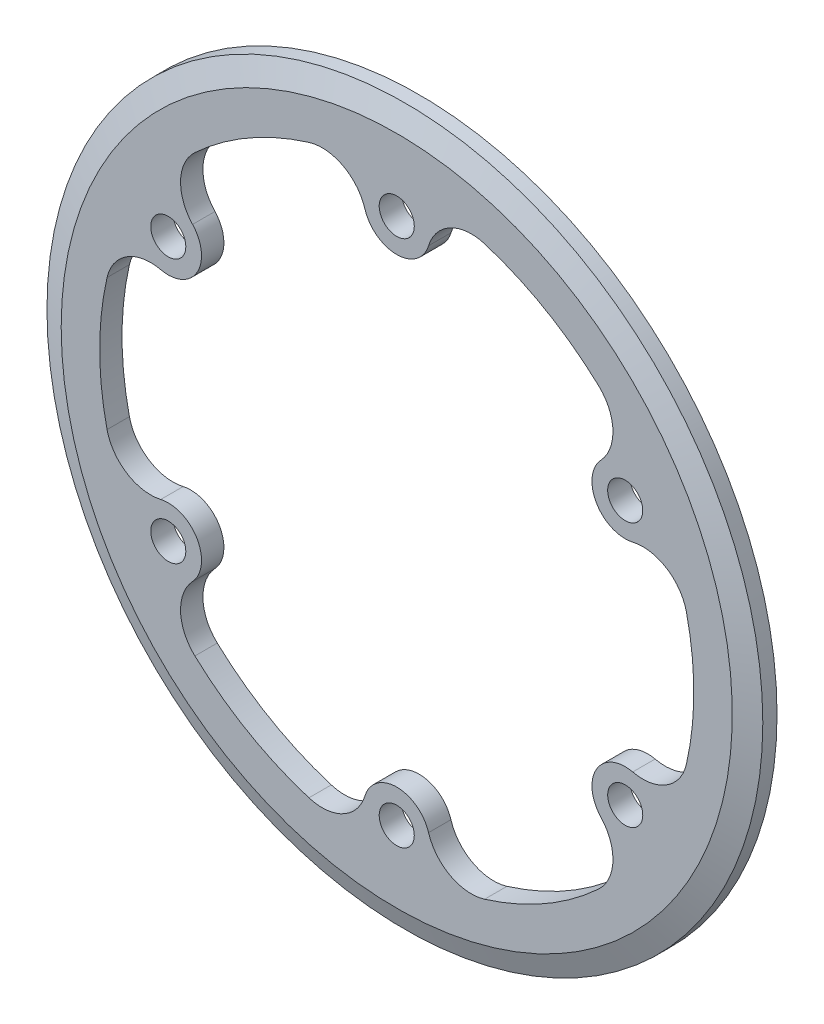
ISO-10303-21;
HEADER;
FILE_DESCRIPTION(('STEP AP214'),'2;1');
FILE_NAME('part.step','',(''),(''),'','','');
FILE_SCHEMA(('AUTOMOTIVE_DESIGN { 1 0 10303 214 1 1 1 1 }'));
ENDSEC;
DATA;
#1=APPLICATION_CONTEXT('core data for automotive mechanical design processes');
#2=APPLICATION_PROTOCOL_DEFINITION('international standard','automotive_design',2000,#1);
#3=PRODUCT_CONTEXT('',#1,'mechanical');
#4=PRODUCT('Part','Part','',(#3));
#5=PRODUCT_RELATED_PRODUCT_CATEGORY('part','',(#4));
#6=PRODUCT_DEFINITION_FORMATION('','',#4);
#7=PRODUCT_DEFINITION_CONTEXT('part definition',#1,'design');
#8=PRODUCT_DEFINITION('design','',#6,#7);
#9=PRODUCT_DEFINITION_SHAPE('','',#8);
#10=(LENGTH_UNIT() NAMED_UNIT(*) SI_UNIT(.MILLI.,.METRE.));
#11=(NAMED_UNIT(*) PLANE_ANGLE_UNIT() SI_UNIT($,.RADIAN.));
#12=(NAMED_UNIT(*) SI_UNIT($,.STERADIAN.) SOLID_ANGLE_UNIT());
#13=UNCERTAINTY_MEASURE_WITH_UNIT(LENGTH_MEASURE(1.E-05),#10,'distance_accuracy_value','');
#14=(GEOMETRIC_REPRESENTATION_CONTEXT(3) GLOBAL_UNCERTAINTY_ASSIGNED_CONTEXT((#13)) GLOBAL_UNIT_ASSIGNED_CONTEXT((#10,
#11,#12)) REPRESENTATION_CONTEXT('',''));
#15=CARTESIAN_POINT('',(0.,0.,0.));
#16=DIRECTION('',(0.,0.,1.));
#17=DIRECTION('',(1.,0.,0.));
#18=AXIS2_PLACEMENT_3D('',#15,#16,#17);
#19=CARTESIAN_POINT('',(0.,0.,1.5875));
#20=DIRECTION('',(0.,0.,1.));
#21=DIRECTION('',(1.,0.,0.));
#22=AXIS2_PLACEMENT_3D('',#19,#20,#21);
#23=PLANE('',#22);
#24=CARTESIAN_POINT('',(-24.3347338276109,26.2766688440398,1.5875));
#25=DIRECTION('',(0.,0.,1.));
#26=DIRECTION('',(1.,0.,0.));
#27=AXIS2_PLACEMENT_3D('',#24,#25,#26);
#28=CIRCLE('',#27,6.34999999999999);
#29=CARTESIAN_POINT('',(-28.9762512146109,21.9432156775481,1.5875));
#30=VERTEX_POINT('',#29);
#31=CARTESIAN_POINT('',(-28.6494029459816,30.9356526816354,1.5875));
#32=VERTEX_POINT('',#31);
#33=EDGE_CURVE('E206',#30,#32,#28,.F.);
#34=ORIENTED_EDGE('',*,*,#33,.T.);
#35=CARTESIAN_POINT('',(0.,0.,1.5875));
#36=DIRECTION('',(0.,0.,1.));
#37=DIRECTION('',(1.,0.,0.));
#38=AXIS2_PLACEMENT_3D('',#35,#36,#37);
#39=CIRCLE('',#38,42.164);
#40=CARTESIAN_POINT('',(-12.466359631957,40.2789370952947,1.5875));
#41=VERTEX_POINT('',#40);
#42=EDGE_CURVE('E203',#32,#41,#39,.F.);
#43=ORIENTED_EDGE('',*,*,#42,.T.);
#44=CARTESIAN_POINT('',(-10.5888958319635,34.2128321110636,1.5875));
#45=DIRECTION('',(0.,0.,1.));
#46=DIRECTION('',(1.,0.,0.));
#47=AXIS2_PLACEMENT_3D('',#44,#45,#46);
#48=CIRCLE('',#47,6.34999999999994);
#49=CARTESIAN_POINT('',(-4.51525661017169,36.0657774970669,1.5875));
#50=VERTEX_POINT('',#49);
#51=EDGE_CURVE('E194',#41,#50,#48,.F.);
#52=ORIENTED_EDGE('',*,*,#51,.T.);
#53=CARTESIAN_POINT('',(0.,37.4432916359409,1.5875));
#54=DIRECTION('',(0.,0.,1.));
#55=DIRECTION('',(1.,0.,0.));
#56=AXIS2_PLACEMENT_3D('',#53,#54,#55);
#57=CIRCLE('',#56,4.72070836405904);
#58=CARTESIAN_POINT('',(4.51525661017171,36.0657774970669,1.5875));
#59=VERTEX_POINT('',#58);
#60=EDGE_CURVE('E188',#59,#50,#57,.F.);
#61=ORIENTED_EDGE('',*,*,#60,.F.);
#62=CARTESIAN_POINT('',(10.5888958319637,34.2128321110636,1.5875));
#63=DIRECTION('',(0.,0.,1.));
#64=DIRECTION('',(1.,0.,0.));
#65=AXIS2_PLACEMENT_3D('',#62,#63,#64);
#66=CIRCLE('',#65,6.34999999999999);
#67=CARTESIAN_POINT('',(12.4663596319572,40.2789370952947,1.5875));
#68=VERTEX_POINT('',#67);
#69=EDGE_CURVE('E175',#59,#68,#66,.F.);
#70=ORIENTED_EDGE('',*,*,#69,.T.);
#71=CARTESIAN_POINT('',(0.,0.,1.5875));
#72=DIRECTION('',(0.,0.,1.));
#73=DIRECTION('',(1.,0.,0.));
#74=AXIS2_PLACEMENT_3D('',#71,#72,#73);
#75=CIRCLE('',#74,42.164);
#76=CARTESIAN_POINT('',(28.6494029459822,30.9356526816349,1.5875));
#77=VERTEX_POINT('',#76);
#78=EDGE_CURVE('E269',#68,#77,#75,.F.);
#79=ORIENTED_EDGE('',*,*,#78,.T.);
#80=CARTESIAN_POINT('',(24.3347338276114,26.2766688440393,1.5875));
#81=DIRECTION('',(0.,0.,1.));
#82=DIRECTION('',(1.,0.,0.));
#83=AXIS2_PLACEMENT_3D('',#80,#81,#82);
#84=CIRCLE('',#83,6.34999999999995);
#85=CARTESIAN_POINT('',(28.9762512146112,21.9432156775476,1.5875));
#86=VERTEX_POINT('',#85);
#87=EDGE_CURVE('E265',#77,#86,#84,.F.);
#88=ORIENTED_EDGE('',*,*,#87,.T.);
#89=CARTESIAN_POINT('',(32.4268417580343,18.7216458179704,1.5875));
#90=DIRECTION('',(0.,0.,1.));
#91=DIRECTION('',(1.,0.,0.));
#92=AXIS2_PLACEMENT_3D('',#89,#90,#91);
#93=CIRCLE('',#92,4.72070836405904);
#94=CARTESIAN_POINT('',(33.4915078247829,14.122561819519,1.5875));
#95=VERTEX_POINT('',#94);
#96=EDGE_CURVE('E262',#95,#86,#93,.F.);
#97=ORIENTED_EDGE('',*,*,#96,.F.);
#98=CARTESIAN_POINT('',(34.9236296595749,7.93616326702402,1.5875));
#99=DIRECTION('',(0.,0.,1.));
#100=DIRECTION('',(1.,0.,0.));
#101=AXIS2_PLACEMENT_3D('',#98,#99,#100);
#102=CIRCLE('',#101,6.35);
#103=CARTESIAN_POINT('',(41.1157625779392,9.34328441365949,1.5875));
#104=VERTEX_POINT('',#103);
#105=EDGE_CURVE('E258',#95,#104,#102,.F.);
#106=ORIENTED_EDGE('',*,*,#105,.T.);
#107=CARTESIAN_POINT('',(0.,0.,1.5875));
#108=DIRECTION('',(0.,0.,1.));
#109=DIRECTION('',(1.,0.,0.));
#110=AXIS2_PLACEMENT_3D('',#107,#108,#109);
#111=CIRCLE('',#110,42.164);
#112=CARTESIAN_POINT('',(41.1157625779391,-9.34328441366,1.5875));
#113=VERTEX_POINT('',#112);
#114=EDGE_CURVE('E255',#104,#113,#111,.F.);
#115=ORIENTED_EDGE('',*,*,#114,.T.);
#116=CARTESIAN_POINT('',(34.9236296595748,-7.93616326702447,1.5875));
#117=DIRECTION('',(0.,0.,1.));
#118=DIRECTION('',(1.,0.,0.));
#119=AXIS2_PLACEMENT_3D('',#116,#117,#118);
#120=CIRCLE('',#119,6.34999999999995);
#121=CARTESIAN_POINT('',(33.4915078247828,-14.1225618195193,1.5875));
#122=VERTEX_POINT('',#121);
#123=EDGE_CURVE('E251',#113,#122,#120,.F.);
#124=ORIENTED_EDGE('',*,*,#123,.T.);
#125=CARTESIAN_POINT('',(32.4268417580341,-18.7216458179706,1.5875));
#126=DIRECTION('',(0.,0.,1.));
#127=DIRECTION('',(1.,0.,0.));
#128=AXIS2_PLACEMENT_3D('',#125,#126,#127);
#129=CIRCLE('',#128,4.72070836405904);
#130=CARTESIAN_POINT('',(28.9762512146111,-21.9432156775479,1.5875));
#131=VERTEX_POINT('',#130);
#132=EDGE_CURVE('E248',#131,#122,#129,.F.);
#133=ORIENTED_EDGE('',*,*,#132,.F.);
#134=CARTESIAN_POINT('',(24.3347338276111,-26.2766688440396,1.5875));
#135=DIRECTION('',(0.,0.,1.));
#136=DIRECTION('',(1.,0.,0.));
#137=AXIS2_PLACEMENT_3D('',#134,#135,#136);
#138=CIRCLE('',#137,6.34999999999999);
#139=CARTESIAN_POINT('',(28.6494029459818,-30.9356526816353,1.5875));
#140=VERTEX_POINT('',#139);
#141=EDGE_CURVE('E245',#131,#140,#138,.F.);
#142=ORIENTED_EDGE('',*,*,#141,.T.);
#143=CARTESIAN_POINT('',(0.,0.,1.5875));
#144=DIRECTION('',(0.,0.,1.));
#145=DIRECTION('',(1.,0.,0.));
#146=AXIS2_PLACEMENT_3D('',#143,#144,#145);
#147=CIRCLE('',#146,42.164);
#148=CARTESIAN_POINT('',(12.466359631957,-40.2789370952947,1.5875));
#149=VERTEX_POINT('',#148);
#150=EDGE_CURVE('E242',#140,#149,#147,.F.);
#151=ORIENTED_EDGE('',*,*,#150,.T.);
#152=CARTESIAN_POINT('',(10.5888958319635,-34.2128321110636,1.5875));
#153=DIRECTION('',(0.,0.,1.));
#154=DIRECTION('',(1.,0.,0.));
#155=AXIS2_PLACEMENT_3D('',#152,#153,#154);
#156=CIRCLE('',#155,6.34999999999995);
#157=CARTESIAN_POINT('',(4.51525661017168,-36.0657774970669,1.5875));
#158=VERTEX_POINT('',#157);
#159=EDGE_CURVE('E238',#149,#158,#156,.F.);
#160=ORIENTED_EDGE('',*,*,#159,.T.);
#161=CARTESIAN_POINT('',(0.,-37.4432916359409,1.5875));
#162=DIRECTION('',(0.,0.,1.));
#163=DIRECTION('',(1.,0.,0.));
#164=AXIS2_PLACEMENT_3D('',#161,#162,#163);
#165=CIRCLE('',#164,4.72070836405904);
#166=CARTESIAN_POINT('',(-4.51525661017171,-36.0657774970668,1.5875));
#167=VERTEX_POINT('',#166);
#168=EDGE_CURVE('E235',#167,#158,#165,.F.);
#169=ORIENTED_EDGE('',*,*,#168,.F.);
#170=CARTESIAN_POINT('',(-10.5888958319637,-34.2128321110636,1.5875));
#171=DIRECTION('',(0.,0.,1.));
#172=DIRECTION('',(1.,0.,0.));
#173=AXIS2_PLACEMENT_3D('',#170,#171,#172);
#174=CIRCLE('',#173,6.35);
#175=CARTESIAN_POINT('',(-12.4663596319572,-40.2789370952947,1.5875));
#176=VERTEX_POINT('',#175);
#177=EDGE_CURVE('E232',#167,#176,#174,.F.);
#178=ORIENTED_EDGE('',*,*,#177,.T.);
#179=CARTESIAN_POINT('',(0.,0.,1.5875));
#180=DIRECTION('',(0.,0.,1.));
#181=DIRECTION('',(1.,0.,0.));
#182=AXIS2_PLACEMENT_3D('',#179,#180,#181);
#183=CIRCLE('',#182,42.164);
#184=CARTESIAN_POINT('',(-28.6494029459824,-30.9356526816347,1.5875));
#185=VERTEX_POINT('',#184);
#186=EDGE_CURVE('E229',#176,#185,#183,.F.);
#187=ORIENTED_EDGE('',*,*,#186,.T.);
#188=CARTESIAN_POINT('',(-24.3347338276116,-26.2766688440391,1.5875));
#189=DIRECTION('',(0.,0.,1.));
#190=DIRECTION('',(1.,0.,0.));
#191=AXIS2_PLACEMENT_3D('',#188,#189,#190);
#192=CIRCLE('',#191,6.34999999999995);
#193=CARTESIAN_POINT('',(-28.9762512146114,-21.9432156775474,1.5875));
#194=VERTEX_POINT('',#193);
#195=EDGE_CURVE('E225',#185,#194,#192,.F.);
#196=ORIENTED_EDGE('',*,*,#195,.T.);
#197=CARTESIAN_POINT('',(-32.4268417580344,-18.7216458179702,1.5875));
#198=DIRECTION('',(0.,0.,1.));
#199=DIRECTION('',(1.,0.,0.));
#200=AXIS2_PLACEMENT_3D('',#197,#198,#199);
#201=CIRCLE('',#200,4.72070836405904);
#202=CARTESIAN_POINT('',(-33.491507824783,-14.1225618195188,1.5875));
#203=VERTEX_POINT('',#202);
#204=EDGE_CURVE('E222',#203,#194,#201,.F.);
#205=ORIENTED_EDGE('',*,*,#204,.F.);
#206=CARTESIAN_POINT('',(-34.9236296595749,-7.93616326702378,1.5875));
#207=DIRECTION('',(0.,0.,1.));
#208=DIRECTION('',(1.,0.,0.));
#209=AXIS2_PLACEMENT_3D('',#206,#207,#208);
#210=CIRCLE('',#209,6.35);
#211=CARTESIAN_POINT('',(-41.1157625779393,-9.34328441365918,1.5875));
#212=VERTEX_POINT('',#211);
#213=EDGE_CURVE('E219',#203,#212,#210,.F.);
#214=ORIENTED_EDGE('',*,*,#213,.T.);
#215=CARTESIAN_POINT('',(0.,0.,1.5875));
#216=DIRECTION('',(0.,0.,1.));
#217=DIRECTION('',(1.,0.,0.));
#218=AXIS2_PLACEMENT_3D('',#215,#216,#217);
#219=CIRCLE('',#218,42.164);
#220=CARTESIAN_POINT('',(-41.115762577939,9.34328441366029,1.5875));
#221=VERTEX_POINT('',#220);
#222=EDGE_CURVE('E216',#212,#221,#219,.F.);
#223=ORIENTED_EDGE('',*,*,#222,.T.);
#224=CARTESIAN_POINT('',(-34.9236296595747,7.93616326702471,1.5875));
#225=DIRECTION('',(0.,0.,1.));
#226=DIRECTION('',(1.,0.,0.));
#227=AXIS2_PLACEMENT_3D('',#224,#225,#226);
#228=CIRCLE('',#227,6.34999999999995);
#229=CARTESIAN_POINT('',(-33.4915078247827,14.1225618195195,1.5875));
#230=VERTEX_POINT('',#229);
#231=EDGE_CURVE('E212',#221,#230,#228,.F.);
#232=ORIENTED_EDGE('',*,*,#231,.T.);
#233=CARTESIAN_POINT('',(-32.426841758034,18.7216458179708,1.5875));
#234=DIRECTION('',(0.,0.,1.));
#235=DIRECTION('',(1.,0.,0.));
#236=AXIS2_PLACEMENT_3D('',#233,#234,#235);
#237=CIRCLE('',#236,4.72070836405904);
#238=EDGE_CURVE('E209',#30,#230,#237,.F.);
#239=ORIENTED_EDGE('',*,*,#238,.F.);
#240=EDGE_LOOP('',(#34,#43,#52,#61,#70,#79,#88,#97,#106,#115,#124,#133,#142,#151,#160,#169,#178,
#187,#196,#205,#214,#223,#232,#239));
#241=FACE_BOUND('',#240,.T.);
#242=CARTESIAN_POINT('',(0.,37.4432916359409,1.5875));
#243=DIRECTION('',(0.,0.,1.));
#244=DIRECTION('',(1.,0.,0.));
#245=AXIS2_PLACEMENT_3D('',#242,#243,#244);
#246=CIRCLE('',#245,2.4892);
#247=CARTESIAN_POINT('',(2.4892,37.4432916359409,1.5875));
#248=VERTEX_POINT('',#247);
#249=EDGE_CURVE('E185',#248,#248,#246,.F.);
#250=ORIENTED_EDGE('',*,*,#249,.T.);
#251=EDGE_LOOP('',(#250));
#252=FACE_BOUND('',#251,.T.);
#253=CARTESIAN_POINT('',(32.4268417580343,18.7216458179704,1.5875));
#254=DIRECTION('',(0.,0.,1.));
#255=DIRECTION('',(1.,0.,0.));
#256=AXIS2_PLACEMENT_3D('',#253,#254,#255);
#257=CIRCLE('',#256,2.4892);
#258=CARTESIAN_POINT('',(34.9160417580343,18.7216458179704,1.5875));
#259=VERTEX_POINT('',#258);
#260=EDGE_CURVE('E273',#259,#259,#257,.F.);
#261=ORIENTED_EDGE('',*,*,#260,.T.);
#262=EDGE_LOOP('',(#261));
#263=FACE_BOUND('',#262,.T.);
#264=CARTESIAN_POINT('',(32.4268417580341,-18.7216458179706,1.5875));
#265=DIRECTION('',(0.,0.,1.));
#266=DIRECTION('',(1.,0.,0.));
#267=AXIS2_PLACEMENT_3D('',#264,#265,#266);
#268=CIRCLE('',#267,2.4892);
#269=CARTESIAN_POINT('',(34.9160417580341,-18.7216458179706,1.5875));
#270=VERTEX_POINT('',#269);
#271=EDGE_CURVE('E276',#270,#270,#268,.F.);
#272=ORIENTED_EDGE('',*,*,#271,.T.);
#273=EDGE_LOOP('',(#272));
#274=FACE_BOUND('',#273,.T.);
#275=CARTESIAN_POINT('',(0.,-37.4432916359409,1.5875));
#276=DIRECTION('',(0.,0.,1.));
#277=DIRECTION('',(1.,0.,0.));
#278=AXIS2_PLACEMENT_3D('',#275,#276,#277);
#279=CIRCLE('',#278,2.4892);
#280=CARTESIAN_POINT('',(2.4892,-37.4432916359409,1.5875));
#281=VERTEX_POINT('',#280);
#282=EDGE_CURVE('E279',#281,#281,#279,.F.);
#283=ORIENTED_EDGE('',*,*,#282,.T.);
#284=EDGE_LOOP('',(#283));
#285=FACE_BOUND('',#284,.T.);
#286=CARTESIAN_POINT('',(-32.4268417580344,-18.7216458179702,1.5875));
#287=DIRECTION('',(0.,0.,1.));
#288=DIRECTION('',(1.,0.,0.));
#289=AXIS2_PLACEMENT_3D('',#286,#287,#288);
#290=CIRCLE('',#289,2.4892);
#291=CARTESIAN_POINT('',(-29.9376417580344,-18.7216458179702,1.5875));
#292=VERTEX_POINT('',#291);
#293=EDGE_CURVE('E282',#292,#292,#290,.F.);
#294=ORIENTED_EDGE('',*,*,#293,.T.);
#295=EDGE_LOOP('',(#294));
#296=FACE_BOUND('',#295,.T.);
#297=CARTESIAN_POINT('',(-32.426841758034,18.7216458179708,1.5875));
#298=DIRECTION('',(0.,0.,1.));
#299=DIRECTION('',(1.,0.,0.));
#300=AXIS2_PLACEMENT_3D('',#297,#298,#299);
#301=CIRCLE('',#300,2.4892);
#302=CARTESIAN_POINT('',(-29.937641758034,18.7216458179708,1.5875));
#303=VERTEX_POINT('',#302);
#304=EDGE_CURVE('E284',#303,#303,#301,.F.);
#305=ORIENTED_EDGE('',*,*,#304,.T.);
#306=EDGE_LOOP('',(#305));
#307=FACE_BOUND('',#306,.T.);
#308=CARTESIAN_POINT('',(0.,0.,1.5875));
#309=DIRECTION('',(0.,0.,-1.));
#310=DIRECTION('',(-1.,0.,0.));
#311=AXIS2_PLACEMENT_3D('',#308,#309,#310);
#312=CIRCLE('',#311,47.625);
#313=CARTESIAN_POINT('',(-47.625,0.,1.5875));
#314=VERTEX_POINT('',#313);
#315=EDGE_CURVE('E19',#314,#314,#312,.T.);
#316=ORIENTED_EDGE('',*,*,#315,.F.);
#317=EDGE_LOOP('',(#316));
#318=FACE_BOUND('',#317,.T.);
#319=ADVANCED_FACE('F16',(#241,#252,#263,#274,#285,#296,#307,#318),#23,.T.);
#320=CARTESIAN_POINT('',(0.,0.,0.431894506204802));
#321=DIRECTION('',(0.,0.,-1.));
#322=DIRECTION('',(-1.,0.,0.));
#323=AXIS2_PLACEMENT_3D('',#320,#321,#322);
#324=CONICAL_SURFACE('',#323,50.8,1.22173047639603);
#325=ORIENTED_EDGE('',*,*,#315,.T.);
#326=EDGE_LOOP('',(#325));
#327=FACE_BOUND('',#326,.T.);
#328=CARTESIAN_POINT('',(0.,0.,0.431894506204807));
#329=DIRECTION('',(0.,0.,-1.));
#330=DIRECTION('',(-1.,0.,0.));
#331=AXIS2_PLACEMENT_3D('',#328,#329,#330);
#332=CIRCLE('',#331,50.8);
#333=CARTESIAN_POINT('',(-50.8,0.,0.431894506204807));
#334=VERTEX_POINT('',#333);
#335=EDGE_CURVE('E190',#334,#334,#332,.T.);
#336=ORIENTED_EDGE('',*,*,#335,.F.);
#337=EDGE_LOOP('',(#336));
#338=FACE_BOUND('',#337,.T.);
#339=ADVANCED_FACE('F291',(#327,#338),#324,.T.);
#340=CARTESIAN_POINT('',(-32.426841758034,18.7216458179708,-1.5875));
#341=DIRECTION('',(0.,0.,1.));
#342=DIRECTION('',(1.,0.,0.));
#343=AXIS2_PLACEMENT_3D('',#340,#341,#342);
#344=CYLINDRICAL_SURFACE('',#343,2.4892);
#345=CARTESIAN_POINT('',(-32.426841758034,18.7216458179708,-1.5875));
#346=DIRECTION('',(0.,0.,1.));
#347=DIRECTION('',(1.,0.,0.));
#348=AXIS2_PLACEMENT_3D('',#345,#346,#347);
#349=CIRCLE('',#348,2.4892);
#350=CARTESIAN_POINT('',(-29.937641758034,18.7216458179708,-1.5875));
#351=VERTEX_POINT('',#350);
#352=EDGE_CURVE('E200',#351,#351,#349,.F.);
#353=ORIENTED_EDGE('',*,*,#352,.T.);
#354=EDGE_LOOP('',(#353));
#355=FACE_BOUND('',#354,.T.);
#356=ORIENTED_EDGE('',*,*,#304,.F.);
#357=EDGE_LOOP('',(#356));
#358=FACE_BOUND('',#357,.T.);
#359=ADVANCED_FACE('F299',(#355,#358),#344,.F.);
#360=CARTESIAN_POINT('',(-32.4268417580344,-18.7216458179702,-1.5875));
#361=DIRECTION('',(0.,0.,1.));
#362=DIRECTION('',(1.,0.,0.));
#363=AXIS2_PLACEMENT_3D('',#360,#361,#362);
#364=CYLINDRICAL_SURFACE('',#363,2.4892);
#365=CARTESIAN_POINT('',(-32.4268417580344,-18.7216458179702,-1.5875));
#366=DIRECTION('',(0.,0.,1.));
#367=DIRECTION('',(1.,0.,0.));
#368=AXIS2_PLACEMENT_3D('',#365,#366,#367);
#369=CIRCLE('',#368,2.4892);
#370=CARTESIAN_POINT('',(-29.9376417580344,-18.7216458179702,-1.5875));
#371=VERTEX_POINT('',#370);
#372=EDGE_CURVE('E433',#371,#371,#369,.F.);
#373=ORIENTED_EDGE('',*,*,#372,.T.);
#374=EDGE_LOOP('',(#373));
#375=FACE_BOUND('',#374,.T.);
#376=ORIENTED_EDGE('',*,*,#293,.F.);
#377=EDGE_LOOP('',(#376));
#378=FACE_BOUND('',#377,.T.);
#379=ADVANCED_FACE('F420',(#375,#378),#364,.F.);
#380=CARTESIAN_POINT('',(0.,-37.4432916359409,-1.5875));
#381=DIRECTION('',(0.,0.,1.));
#382=DIRECTION('',(1.,0.,0.));
#383=AXIS2_PLACEMENT_3D('',#380,#381,#382);
#384=CYLINDRICAL_SURFACE('',#383,2.4892);
#385=CARTESIAN_POINT('',(0.,-37.4432916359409,-1.5875));
#386=DIRECTION('',(0.,0.,1.));
#387=DIRECTION('',(1.,0.,0.));
#388=AXIS2_PLACEMENT_3D('',#385,#386,#387);
#389=CIRCLE('',#388,2.4892);
#390=CARTESIAN_POINT('',(2.4892,-37.4432916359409,-1.5875));
#391=VERTEX_POINT('',#390);
#392=EDGE_CURVE('E435',#391,#391,#389,.F.);
#393=ORIENTED_EDGE('',*,*,#392,.T.);
#394=EDGE_LOOP('',(#393));
#395=FACE_BOUND('',#394,.T.);
#396=ORIENTED_EDGE('',*,*,#282,.F.);
#397=EDGE_LOOP('',(#396));
#398=FACE_BOUND('',#397,.T.);
#399=ADVANCED_FACE('F416',(#395,#398),#384,.F.);
#400=CARTESIAN_POINT('',(32.4268417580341,-18.7216458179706,-1.5875));
#401=DIRECTION('',(0.,0.,1.));
#402=DIRECTION('',(1.,0.,0.));
#403=AXIS2_PLACEMENT_3D('',#400,#401,#402);
#404=CYLINDRICAL_SURFACE('',#403,2.4892);
#405=CARTESIAN_POINT('',(32.4268417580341,-18.7216458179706,-1.5875));
#406=DIRECTION('',(0.,0.,1.));
#407=DIRECTION('',(1.,0.,0.));
#408=AXIS2_PLACEMENT_3D('',#405,#406,#407);
#409=CIRCLE('',#408,2.4892);
#410=CARTESIAN_POINT('',(34.9160417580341,-18.7216458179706,-1.5875));
#411=VERTEX_POINT('',#410);
#412=EDGE_CURVE('E512',#411,#411,#409,.F.);
#413=ORIENTED_EDGE('',*,*,#412,.T.);
#414=EDGE_LOOP('',(#413));
#415=FACE_BOUND('',#414,.T.);
#416=ORIENTED_EDGE('',*,*,#271,.F.);
#417=EDGE_LOOP('',(#416));
#418=FACE_BOUND('',#417,.T.);
#419=ADVANCED_FACE('F412',(#415,#418),#404,.F.);
#420=CARTESIAN_POINT('',(32.4268417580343,18.7216458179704,-1.5875));
#421=DIRECTION('',(0.,0.,1.));
#422=DIRECTION('',(1.,0.,0.));
#423=AXIS2_PLACEMENT_3D('',#420,#421,#422);
#424=CYLINDRICAL_SURFACE('',#423,2.4892);
#425=CARTESIAN_POINT('',(32.4268417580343,18.7216458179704,-1.5875));
#426=DIRECTION('',(0.,0.,1.));
#427=DIRECTION('',(1.,0.,0.));
#428=AXIS2_PLACEMENT_3D('',#425,#426,#427);
#429=CIRCLE('',#428,2.4892);
#430=CARTESIAN_POINT('',(34.9160417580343,18.7216458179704,-1.5875));
#431=VERTEX_POINT('',#430);
#432=EDGE_CURVE('E509',#431,#431,#429,.F.);
#433=ORIENTED_EDGE('',*,*,#432,.T.);
#434=EDGE_LOOP('',(#433));
#435=FACE_BOUND('',#434,.T.);
#436=ORIENTED_EDGE('',*,*,#260,.F.);
#437=EDGE_LOOP('',(#436));
#438=FACE_BOUND('',#437,.T.);
#439=ADVANCED_FACE('F408',(#435,#438),#424,.F.);
#440=CARTESIAN_POINT('',(0.,37.4432916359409,-1.5875));
#441=DIRECTION('',(0.,0.,1.));
#442=DIRECTION('',(1.,0.,0.));
#443=AXIS2_PLACEMENT_3D('',#440,#441,#442);
#444=CYLINDRICAL_SURFACE('',#443,2.4892);
#445=CARTESIAN_POINT('',(0.,37.4432916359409,-1.5875));
#446=DIRECTION('',(0.,0.,1.));
#447=DIRECTION('',(1.,0.,0.));
#448=AXIS2_PLACEMENT_3D('',#445,#446,#447);
#449=CIRCLE('',#448,2.4892);
#450=CARTESIAN_POINT('',(2.4892,37.4432916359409,-1.5875));
#451=VERTEX_POINT('',#450);
#452=EDGE_CURVE('E506',#451,#451,#449,.F.);
#453=ORIENTED_EDGE('',*,*,#452,.T.);
#454=EDGE_LOOP('',(#453));
#455=FACE_BOUND('',#454,.T.);
#456=ORIENTED_EDGE('',*,*,#249,.F.);
#457=EDGE_LOOP('',(#456));
#458=FACE_BOUND('',#457,.T.);
#459=ADVANCED_FACE('F405',(#455,#458),#444,.F.);
#460=CARTESIAN_POINT('',(10.5888958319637,34.2128321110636,-1.5875));
#461=DIRECTION('',(0.,0.,1.));
#462=DIRECTION('',(1.,0.,0.));
#463=AXIS2_PLACEMENT_3D('',#460,#461,#462);
#464=CYLINDRICAL_SURFACE('',#463,6.34999999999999);
#465=DIRECTION('',(0.,0.,1.));
#466=VECTOR('',#465,1.);
#467=CARTESIAN_POINT('',(4.51525661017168,36.0657774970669,-1.5875));
#468=LINE('',#467,#466);
#469=CARTESIAN_POINT('',(4.51525661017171,36.0657774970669,-1.5875));
#470=VERTEX_POINT('',#469);
#471=EDGE_CURVE('E179',#470,#59,#468,.T.);
#472=ORIENTED_EDGE('',*,*,#471,.F.);
#473=CARTESIAN_POINT('',(10.5888958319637,34.2128321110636,-1.5875));
#474=DIRECTION('',(0.,0.,1.));
#475=DIRECTION('',(1.,0.,0.));
#476=AXIS2_PLACEMENT_3D('',#473,#474,#475);
#477=CIRCLE('',#476,6.34999999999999);
#478=CARTESIAN_POINT('',(12.4663596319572,40.2789370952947,-1.5875));
#479=VERTEX_POINT('',#478);
#480=EDGE_CURVE('E504',#470,#479,#477,.F.);
#481=ORIENTED_EDGE('',*,*,#480,.T.);
#482=DIRECTION('',(0.,0.,1.));
#483=VECTOR('',#482,1.);
#484=CARTESIAN_POINT('',(12.4663596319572,40.2789370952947,-1.5875));
#485=LINE('',#484,#483);
#486=EDGE_CURVE('E180',#479,#68,#485,.T.);
#487=ORIENTED_EDGE('',*,*,#486,.T.);
#488=ORIENTED_EDGE('',*,*,#69,.F.);
#489=EDGE_LOOP('',(#472,#481,#487,#488));
#490=FACE_BOUND('',#489,.T.);
#491=ADVANCED_FACE('F177',(#490),#464,.F.);
#492=CARTESIAN_POINT('',(0.,0.,-1.5875));
#493=DIRECTION('',(0.,0.,1.));
#494=DIRECTION('',(1.,0.,0.));
#495=AXIS2_PLACEMENT_3D('',#492,#493,#494);
#496=CYLINDRICAL_SURFACE('',#495,42.164);
#497=ORIENTED_EDGE('',*,*,#486,.F.);
#498=CARTESIAN_POINT('',(0.,0.,-1.5875));
#499=DIRECTION('',(0.,0.,1.));
#500=DIRECTION('',(1.,0.,0.));
#501=AXIS2_PLACEMENT_3D('',#498,#499,#500);
#502=CIRCLE('',#501,42.164);
#503=CARTESIAN_POINT('',(28.6494029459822,30.9356526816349,-1.5875));
#504=VERTEX_POINT('',#503);
#505=EDGE_CURVE('E501',#479,#504,#502,.F.);
#506=ORIENTED_EDGE('',*,*,#505,.T.);
#507=DIRECTION('',(0.,0.,1.));
#508=VECTOR('',#507,1.);
#509=CARTESIAN_POINT('',(28.6494029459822,30.9356526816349,-1.5875));
#510=LINE('',#509,#508);
#511=EDGE_CURVE('E268',#504,#77,#510,.T.);
#512=ORIENTED_EDGE('',*,*,#511,.T.);
#513=ORIENTED_EDGE('',*,*,#78,.F.);
#514=EDGE_LOOP('',(#497,#506,#512,#513));
#515=FACE_BOUND('',#514,.T.);
#516=ADVANCED_FACE('F398',(#515),#496,.F.);
#517=CARTESIAN_POINT('',(24.3347338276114,26.2766688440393,-1.5875));
#518=DIRECTION('',(0.,0.,1.));
#519=DIRECTION('',(1.,0.,0.));
#520=AXIS2_PLACEMENT_3D('',#517,#518,#519);
#521=CYLINDRICAL_SURFACE('',#520,6.34999999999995);
#522=CARTESIAN_POINT('',(24.3347338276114,26.2766688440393,-1.5875));
#523=DIRECTION('',(0.,0.,1.));
#524=DIRECTION('',(1.,0.,0.));
#525=AXIS2_PLACEMENT_3D('',#522,#523,#524);
#526=CIRCLE('',#525,6.34999999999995);
#527=CARTESIAN_POINT('',(28.9762512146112,21.9432156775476,-1.5875));
#528=VERTEX_POINT('',#527);
#529=EDGE_CURVE('E499',#504,#528,#526,.F.);
#530=ORIENTED_EDGE('',*,*,#529,.T.);
#531=DIRECTION('',(0.,0.,1.));
#532=VECTOR('',#531,1.);
#533=CARTESIAN_POINT('',(28.9762512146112,21.9432156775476,-1.5875));
#534=LINE('',#533,#532);
#535=EDGE_CURVE('E264',#86,#528,#534,.F.);
#536=ORIENTED_EDGE('',*,*,#535,.F.);
#537=ORIENTED_EDGE('',*,*,#87,.F.);
#538=ORIENTED_EDGE('',*,*,#511,.F.);
#539=EDGE_LOOP('',(#530,#536,#537,#538));
#540=FACE_BOUND('',#539,.T.);
#541=ADVANCED_FACE('F394',(#540),#521,.F.);
#542=CARTESIAN_POINT('',(32.4268417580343,18.7216458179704,-1.5875));
#543=DIRECTION('',(0.,0.,1.));
#544=DIRECTION('',(1.,0.,0.));
#545=AXIS2_PLACEMENT_3D('',#542,#543,#544);
#546=CYLINDRICAL_SURFACE('',#545,4.72070836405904);
#547=CARTESIAN_POINT('',(32.4268417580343,18.7216458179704,-1.5875));
#548=DIRECTION('',(0.,0.,1.));
#549=DIRECTION('',(1.,0.,0.));
#550=AXIS2_PLACEMENT_3D('',#547,#548,#549);
#551=CIRCLE('',#550,4.72070836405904);
#552=CARTESIAN_POINT('',(33.4915078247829,14.122561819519,-1.5875));
#553=VERTEX_POINT('',#552);
#554=EDGE_CURVE('E496',#528,#553,#551,.T.);
#555=ORIENTED_EDGE('',*,*,#554,.T.);
#556=DIRECTION('',(0.,0.,1.));
#557=VECTOR('',#556,1.);
#558=CARTESIAN_POINT('',(33.4915078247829,14.122561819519,-1.5875));
#559=LINE('',#558,#557);
#560=EDGE_CURVE('E261',#553,#95,#559,.T.);
#561=ORIENTED_EDGE('',*,*,#560,.T.);
#562=ORIENTED_EDGE('',*,*,#96,.T.);
#563=ORIENTED_EDGE('',*,*,#535,.T.);
#564=EDGE_LOOP('',(#555,#561,#562,#563));
#565=FACE_BOUND('',#564,.T.);
#566=ADVANCED_FACE('F390',(#565),#546,.T.);
#567=CARTESIAN_POINT('',(34.9236296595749,7.93616326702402,-1.5875));
#568=DIRECTION('',(0.,0.,1.));
#569=DIRECTION('',(1.,0.,0.));
#570=AXIS2_PLACEMENT_3D('',#567,#568,#569);
#571=CYLINDRICAL_SURFACE('',#570,6.35);
#572=ORIENTED_EDGE('',*,*,#560,.F.);
#573=CARTESIAN_POINT('',(34.9236296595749,7.93616326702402,-1.5875));
#574=DIRECTION('',(0.,0.,1.));
#575=DIRECTION('',(1.,0.,0.));
#576=AXIS2_PLACEMENT_3D('',#573,#574,#575);
#577=CIRCLE('',#576,6.35);
#578=CARTESIAN_POINT('',(41.1157625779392,9.34328441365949,-1.5875));
#579=VERTEX_POINT('',#578);
#580=EDGE_CURVE('E493',#553,#579,#577,.F.);
#581=ORIENTED_EDGE('',*,*,#580,.T.);
#582=DIRECTION('',(0.,0.,1.));
#583=VECTOR('',#582,1.);
#584=CARTESIAN_POINT('',(41.1157625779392,9.3432844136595,-1.5875));
#585=LINE('',#584,#583);
#586=EDGE_CURVE('E257',#579,#104,#585,.T.);
#587=ORIENTED_EDGE('',*,*,#586,.T.);
#588=ORIENTED_EDGE('',*,*,#105,.F.);
#589=EDGE_LOOP('',(#572,#581,#587,#588));
#590=FACE_BOUND('',#589,.T.);
#591=ADVANCED_FACE('F386',(#590),#571,.F.);
#592=CARTESIAN_POINT('',(0.,0.,-1.5875));
#593=DIRECTION('',(0.,0.,1.));
#594=DIRECTION('',(1.,0.,0.));
#595=AXIS2_PLACEMENT_3D('',#592,#593,#594);
#596=CYLINDRICAL_SURFACE('',#595,42.164);
#597=CARTESIAN_POINT('',(0.,0.,-1.5875));
#598=DIRECTION('',(0.,0.,1.));
#599=DIRECTION('',(1.,0.,0.));
#600=AXIS2_PLACEMENT_3D('',#597,#598,#599);
#601=CIRCLE('',#600,42.164);
#602=CARTESIAN_POINT('',(41.1157625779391,-9.34328441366,-1.5875));
#603=VERTEX_POINT('',#602);
#604=EDGE_CURVE('E491',#579,#603,#601,.F.);
#605=ORIENTED_EDGE('',*,*,#604,.T.);
#606=DIRECTION('',(0.,0.,1.));
#607=VECTOR('',#606,1.);
#608=CARTESIAN_POINT('',(41.1157625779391,-9.34328441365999,-1.5875));
#609=LINE('',#608,#607);
#610=EDGE_CURVE('E254',#603,#113,#609,.T.);
#611=ORIENTED_EDGE('',*,*,#610,.T.);
#612=ORIENTED_EDGE('',*,*,#114,.F.);
#613=ORIENTED_EDGE('',*,*,#586,.F.);
#614=EDGE_LOOP('',(#605,#611,#612,#613));
#615=FACE_BOUND('',#614,.T.);
#616=ADVANCED_FACE('F382',(#615),#596,.F.);
#617=CARTESIAN_POINT('',(34.9236296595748,-7.93616326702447,-1.5875));
#618=DIRECTION('',(0.,0.,1.));
#619=DIRECTION('',(1.,0.,0.));
#620=AXIS2_PLACEMENT_3D('',#617,#618,#619);
#621=CYLINDRICAL_SURFACE('',#620,6.34999999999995);
#622=ORIENTED_EDGE('',*,*,#610,.F.);
#623=CARTESIAN_POINT('',(34.9236296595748,-7.93616326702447,-1.5875));
#624=DIRECTION('',(0.,0.,1.));
#625=DIRECTION('',(1.,0.,0.));
#626=AXIS2_PLACEMENT_3D('',#623,#624,#625);
#627=CIRCLE('',#626,6.34999999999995);
#628=CARTESIAN_POINT('',(33.4915078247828,-14.1225618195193,-1.5875));
#629=VERTEX_POINT('',#628);
#630=EDGE_CURVE('E488',#603,#629,#627,.F.);
#631=ORIENTED_EDGE('',*,*,#630,.T.);
#632=DIRECTION('',(0.,0.,1.));
#633=VECTOR('',#632,1.);
#634=CARTESIAN_POINT('',(33.4915078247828,-14.1225618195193,-1.5875));
#635=LINE('',#634,#633);
#636=EDGE_CURVE('E250',#122,#629,#635,.F.);
#637=ORIENTED_EDGE('',*,*,#636,.F.);
#638=ORIENTED_EDGE('',*,*,#123,.F.);
#639=EDGE_LOOP('',(#622,#631,#637,#638));
#640=FACE_BOUND('',#639,.T.);
#641=ADVANCED_FACE('F378',(#640),#621,.F.);
#642=CARTESIAN_POINT('',(32.4268417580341,-18.7216458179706,-1.5875));
#643=DIRECTION('',(0.,0.,1.));
#644=DIRECTION('',(1.,0.,0.));
#645=AXIS2_PLACEMENT_3D('',#642,#643,#644);
#646=CYLINDRICAL_SURFACE('',#645,4.72070836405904);
#647=CARTESIAN_POINT('',(32.4268417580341,-18.7216458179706,-1.5875));
#648=DIRECTION('',(0.,0.,1.));
#649=DIRECTION('',(1.,0.,0.));
#650=AXIS2_PLACEMENT_3D('',#647,#648,#649);
#651=CIRCLE('',#650,4.72070836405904);
#652=CARTESIAN_POINT('',(28.9762512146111,-21.9432156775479,-1.5875));
#653=VERTEX_POINT('',#652);
#654=EDGE_CURVE('E485',#629,#653,#651,.T.);
#655=ORIENTED_EDGE('',*,*,#654,.T.);
#656=DIRECTION('',(0.,0.,1.));
#657=VECTOR('',#656,1.);
#658=CARTESIAN_POINT('',(28.9762512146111,-21.9432156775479,-1.5875));
#659=LINE('',#658,#657);
#660=EDGE_CURVE('E247',#653,#131,#659,.T.);
#661=ORIENTED_EDGE('',*,*,#660,.T.);
#662=ORIENTED_EDGE('',*,*,#132,.T.);
#663=ORIENTED_EDGE('',*,*,#636,.T.);
#664=EDGE_LOOP('',(#655,#661,#662,#663));
#665=FACE_BOUND('',#664,.T.);
#666=ADVANCED_FACE('F374',(#665),#646,.T.);
#667=CARTESIAN_POINT('',(24.3347338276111,-26.2766688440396,-1.5875));
#668=DIRECTION('',(0.,0.,1.));
#669=DIRECTION('',(1.,0.,0.));
#670=AXIS2_PLACEMENT_3D('',#667,#668,#669);
#671=CYLINDRICAL_SURFACE('',#670,6.34999999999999);
#672=CARTESIAN_POINT('',(24.3347338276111,-26.2766688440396,-1.5875));
#673=DIRECTION('',(0.,0.,1.));
#674=DIRECTION('',(1.,0.,0.));
#675=AXIS2_PLACEMENT_3D('',#672,#673,#674);
#676=CIRCLE('',#675,6.34999999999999);
#677=CARTESIAN_POINT('',(28.6494029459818,-30.9356526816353,-1.5875));
#678=VERTEX_POINT('',#677);
#679=EDGE_CURVE('E483',#653,#678,#676,.F.);
#680=ORIENTED_EDGE('',*,*,#679,.T.);
#681=DIRECTION('',(0.,0.,1.));
#682=VECTOR('',#681,1.);
#683=CARTESIAN_POINT('',(28.6494029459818,-30.9356526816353,-1.5875));
#684=LINE('',#683,#682);
#685=EDGE_CURVE('E244',#678,#140,#684,.T.);
#686=ORIENTED_EDGE('',*,*,#685,.T.);
#687=ORIENTED_EDGE('',*,*,#141,.F.);
#688=ORIENTED_EDGE('',*,*,#660,.F.);
#689=EDGE_LOOP('',(#680,#686,#687,#688));
#690=FACE_BOUND('',#689,.T.);
#691=ADVANCED_FACE('F370',(#690),#671,.F.);
#692=CARTESIAN_POINT('',(0.,0.,-1.5875));
#693=DIRECTION('',(0.,0.,1.));
#694=DIRECTION('',(1.,0.,0.));
#695=AXIS2_PLACEMENT_3D('',#692,#693,#694);
#696=CYLINDRICAL_SURFACE('',#695,42.164);
#697=ORIENTED_EDGE('',*,*,#685,.F.);
#698=CARTESIAN_POINT('',(0.,0.,-1.5875));
#699=DIRECTION('',(0.,0.,1.));
#700=DIRECTION('',(1.,0.,0.));
#701=AXIS2_PLACEMENT_3D('',#698,#699,#700);
#702=CIRCLE('',#701,42.164);
#703=CARTESIAN_POINT('',(12.466359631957,-40.2789370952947,-1.5875));
#704=VERTEX_POINT('',#703);
#705=EDGE_CURVE('E480',#678,#704,#702,.F.);
#706=ORIENTED_EDGE('',*,*,#705,.T.);
#707=DIRECTION('',(0.,0.,1.));
#708=VECTOR('',#707,1.);
#709=CARTESIAN_POINT('',(12.466359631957,-40.2789370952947,-1.5875));
#710=LINE('',#709,#708);
#711=EDGE_CURVE('E241',#704,#149,#710,.T.);
#712=ORIENTED_EDGE('',*,*,#711,.T.);
#713=ORIENTED_EDGE('',*,*,#150,.F.);
#714=EDGE_LOOP('',(#697,#706,#712,#713));
#715=FACE_BOUND('',#714,.T.);
#716=ADVANCED_FACE('F366',(#715),#696,.F.);
#717=CARTESIAN_POINT('',(10.5888958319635,-34.2128321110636,-1.5875));
#718=DIRECTION('',(0.,0.,1.));
#719=DIRECTION('',(1.,0.,0.));
#720=AXIS2_PLACEMENT_3D('',#717,#718,#719);
#721=CYLINDRICAL_SURFACE('',#720,6.34999999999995);
#722=ORIENTED_EDGE('',*,*,#711,.F.);
#723=CARTESIAN_POINT('',(10.5888958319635,-34.2128321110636,-1.5875));
#724=DIRECTION('',(0.,0.,1.));
#725=DIRECTION('',(1.,0.,0.));
#726=AXIS2_PLACEMENT_3D('',#723,#724,#725);
#727=CIRCLE('',#726,6.34999999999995);
#728=CARTESIAN_POINT('',(4.51525661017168,-36.0657774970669,-1.5875));
#729=VERTEX_POINT('',#728);
#730=EDGE_CURVE('E477',#704,#729,#727,.F.);
#731=ORIENTED_EDGE('',*,*,#730,.T.);
#732=DIRECTION('',(0.,0.,1.));
#733=VECTOR('',#732,1.);
#734=CARTESIAN_POINT('',(4.51525661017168,-36.0657774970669,-1.5875));
#735=LINE('',#734,#733);
#736=EDGE_CURVE('E237',#158,#729,#735,.F.);
#737=ORIENTED_EDGE('',*,*,#736,.F.);
#738=ORIENTED_EDGE('',*,*,#159,.F.);
#739=EDGE_LOOP('',(#722,#731,#737,#738));
#740=FACE_BOUND('',#739,.T.);
#741=ADVANCED_FACE('F362',(#740),#721,.F.);
#742=CARTESIAN_POINT('',(0.,-37.4432916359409,-1.5875));
#743=DIRECTION('',(0.,0.,1.));
#744=DIRECTION('',(1.,0.,0.));
#745=AXIS2_PLACEMENT_3D('',#742,#743,#744);
#746=CYLINDRICAL_SURFACE('',#745,4.72070836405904);
#747=CARTESIAN_POINT('',(0.,-37.4432916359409,-1.5875));
#748=DIRECTION('',(0.,0.,1.));
#749=DIRECTION('',(1.,0.,0.));
#750=AXIS2_PLACEMENT_3D('',#747,#748,#749);
#751=CIRCLE('',#750,4.72070836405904);
#752=CARTESIAN_POINT('',(-4.51525661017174,-36.0657774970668,-1.5875));
#753=VERTEX_POINT('',#752);
#754=EDGE_CURVE('E474',#729,#753,#751,.T.);
#755=ORIENTED_EDGE('',*,*,#754,.T.);
#756=DIRECTION('',(0.,0.,1.));
#757=VECTOR('',#756,1.);
#758=CARTESIAN_POINT('',(-4.51525661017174,-36.0657774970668,-1.5875));
#759=LINE('',#758,#757);
#760=EDGE_CURVE('E234',#753,#167,#759,.T.);
#761=ORIENTED_EDGE('',*,*,#760,.T.);
#762=ORIENTED_EDGE('',*,*,#168,.T.);
#763=ORIENTED_EDGE('',*,*,#736,.T.);
#764=EDGE_LOOP('',(#755,#761,#762,#763));
#765=FACE_BOUND('',#764,.T.);
#766=ADVANCED_FACE('F358',(#765),#746,.T.);
#767=CARTESIAN_POINT('',(-10.5888958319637,-34.2128321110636,-1.5875));
#768=DIRECTION('',(0.,0.,1.));
#769=DIRECTION('',(1.,0.,0.));
#770=AXIS2_PLACEMENT_3D('',#767,#768,#769);
#771=CYLINDRICAL_SURFACE('',#770,6.35);
#772=ORIENTED_EDGE('',*,*,#760,.F.);
#773=CARTESIAN_POINT('',(-10.5888958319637,-34.2128321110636,-1.5875));
#774=DIRECTION('',(0.,0.,1.));
#775=DIRECTION('',(1.,0.,0.));
#776=AXIS2_PLACEMENT_3D('',#773,#774,#775);
#777=CIRCLE('',#776,6.35);
#778=CARTESIAN_POINT('',(-12.4663596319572,-40.2789370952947,-1.5875));
#779=VERTEX_POINT('',#778);
#780=EDGE_CURVE('E471',#753,#779,#777,.F.);
#781=ORIENTED_EDGE('',*,*,#780,.T.);
#782=DIRECTION('',(0.,0.,1.));
#783=VECTOR('',#782,1.);
#784=CARTESIAN_POINT('',(-12.4663596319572,-40.2789370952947,-1.5875));
#785=LINE('',#784,#783);
#786=EDGE_CURVE('E231',#779,#176,#785,.T.);
#787=ORIENTED_EDGE('',*,*,#786,.T.);
#788=ORIENTED_EDGE('',*,*,#177,.F.);
#789=EDGE_LOOP('',(#772,#781,#787,#788));
#790=FACE_BOUND('',#789,.T.);
#791=ADVANCED_FACE('F354',(#790),#771,.F.);
#792=CARTESIAN_POINT('',(0.,0.,-1.5875));
#793=DIRECTION('',(0.,0.,1.));
#794=DIRECTION('',(1.,0.,0.));
#795=AXIS2_PLACEMENT_3D('',#792,#793,#794);
#796=CYLINDRICAL_SURFACE('',#795,42.164);
#797=ORIENTED_EDGE('',*,*,#786,.F.);
#798=CARTESIAN_POINT('',(0.,0.,-1.5875));
#799=DIRECTION('',(0.,0.,1.));
#800=DIRECTION('',(1.,0.,0.));
#801=AXIS2_PLACEMENT_3D('',#798,#799,#800);
#802=CIRCLE('',#801,42.164);
#803=CARTESIAN_POINT('',(-28.6494029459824,-30.9356526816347,-1.5875));
#804=VERTEX_POINT('',#803);
#805=EDGE_CURVE('E468',#779,#804,#802,.F.);
#806=ORIENTED_EDGE('',*,*,#805,.T.);
#807=DIRECTION('',(0.,0.,1.));
#808=VECTOR('',#807,1.);
#809=CARTESIAN_POINT('',(-28.6494029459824,-30.9356526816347,-1.5875));
#810=LINE('',#809,#808);
#811=EDGE_CURVE('E228',#804,#185,#810,.T.);
#812=ORIENTED_EDGE('',*,*,#811,.T.);
#813=ORIENTED_EDGE('',*,*,#186,.F.);
#814=EDGE_LOOP('',(#797,#806,#812,#813));
#815=FACE_BOUND('',#814,.T.);
#816=ADVANCED_FACE('F350',(#815),#796,.F.);
#817=CARTESIAN_POINT('',(-24.3347338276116,-26.2766688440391,-1.5875));
#818=DIRECTION('',(0.,0.,1.));
#819=DIRECTION('',(1.,0.,0.));
#820=AXIS2_PLACEMENT_3D('',#817,#818,#819);
#821=CYLINDRICAL_SURFACE('',#820,6.34999999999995);
#822=ORIENTED_EDGE('',*,*,#811,.F.);
#823=CARTESIAN_POINT('',(-24.3347338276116,-26.2766688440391,-1.5875));
#824=DIRECTION('',(0.,0.,1.));
#825=DIRECTION('',(1.,0.,0.));
#826=AXIS2_PLACEMENT_3D('',#823,#824,#825);
#827=CIRCLE('',#826,6.34999999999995);
#828=CARTESIAN_POINT('',(-28.9762512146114,-21.9432156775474,-1.5875));
#829=VERTEX_POINT('',#828);
#830=EDGE_CURVE('E465',#804,#829,#827,.F.);
#831=ORIENTED_EDGE('',*,*,#830,.T.);
#832=DIRECTION('',(0.,0.,1.));
#833=VECTOR('',#832,1.);
#834=CARTESIAN_POINT('',(-28.9762512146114,-21.9432156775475,-1.5875));
#835=LINE('',#834,#833);
#836=EDGE_CURVE('E224',#194,#829,#835,.F.);
#837=ORIENTED_EDGE('',*,*,#836,.F.);
#838=ORIENTED_EDGE('',*,*,#195,.F.);
#839=EDGE_LOOP('',(#822,#831,#837,#838));
#840=FACE_BOUND('',#839,.T.);
#841=ADVANCED_FACE('F346',(#840),#821,.F.);
#842=CARTESIAN_POINT('',(-32.4268417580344,-18.7216458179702,-1.5875));
#843=DIRECTION('',(0.,0.,1.));
#844=DIRECTION('',(1.,0.,0.));
#845=AXIS2_PLACEMENT_3D('',#842,#843,#844);
#846=CYLINDRICAL_SURFACE('',#845,4.72070836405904);
#847=DIRECTION('',(0.,0.,1.));
#848=VECTOR('',#847,1.);
#849=CARTESIAN_POINT('',(-33.491507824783,-14.1225618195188,-1.5875));
#850=LINE('',#849,#848);
#851=CARTESIAN_POINT('',(-33.491507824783,-14.1225618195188,-1.5875));
#852=VERTEX_POINT('',#851);
#853=EDGE_CURVE('E221',#852,#203,#850,.T.);
#854=ORIENTED_EDGE('',*,*,#853,.T.);
#855=ORIENTED_EDGE('',*,*,#204,.T.);
#856=ORIENTED_EDGE('',*,*,#836,.T.);
#857=CARTESIAN_POINT('',(-32.4268417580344,-18.7216458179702,-1.5875));
#858=DIRECTION('',(0.,0.,1.));
#859=DIRECTION('',(1.,0.,0.));
#860=AXIS2_PLACEMENT_3D('',#857,#858,#859);
#861=CIRCLE('',#860,4.72070836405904);
#862=EDGE_CURVE('E463',#829,#852,#861,.T.);
#863=ORIENTED_EDGE('',*,*,#862,.T.);
#864=EDGE_LOOP('',(#854,#855,#856,#863));
#865=FACE_BOUND('',#864,.T.);
#866=ADVANCED_FACE('F342',(#865),#846,.T.);
#867=CARTESIAN_POINT('',(-34.9236296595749,-7.93616326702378,-1.5875));
#868=DIRECTION('',(0.,0.,1.));
#869=DIRECTION('',(1.,0.,0.));
#870=AXIS2_PLACEMENT_3D('',#867,#868,#869);
#871=CYLINDRICAL_SURFACE('',#870,6.35);
#872=ORIENTED_EDGE('',*,*,#853,.F.);
#873=CARTESIAN_POINT('',(-34.9236296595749,-7.93616326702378,-1.5875));
#874=DIRECTION('',(0.,0.,1.));
#875=DIRECTION('',(1.,0.,0.));
#876=AXIS2_PLACEMENT_3D('',#873,#874,#875);
#877=CIRCLE('',#876,6.35);
#878=CARTESIAN_POINT('',(-41.1157625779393,-9.34328441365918,-1.5875));
#879=VERTEX_POINT('',#878);
#880=EDGE_CURVE('E460',#852,#879,#877,.F.);
#881=ORIENTED_EDGE('',*,*,#880,.T.);
#882=DIRECTION('',(0.,0.,1.));
#883=VECTOR('',#882,1.);
#884=CARTESIAN_POINT('',(-41.1157625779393,-9.34328441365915,-1.5875));
#885=LINE('',#884,#883);
#886=EDGE_CURVE('E218',#879,#212,#885,.T.);
#887=ORIENTED_EDGE('',*,*,#886,.T.);
#888=ORIENTED_EDGE('',*,*,#213,.F.);
#889=EDGE_LOOP('',(#872,#881,#887,#888));
#890=FACE_BOUND('',#889,.T.);
#891=ADVANCED_FACE('F338',(#890),#871,.F.);
#892=CARTESIAN_POINT('',(0.,0.,-1.5875));
#893=DIRECTION('',(0.,0.,1.));
#894=DIRECTION('',(1.,0.,0.));
#895=AXIS2_PLACEMENT_3D('',#892,#893,#894);
#896=CYLINDRICAL_SURFACE('',#895,42.164);
#897=ORIENTED_EDGE('',*,*,#886,.F.);
#898=CARTESIAN_POINT('',(0.,0.,-1.5875));
#899=DIRECTION('',(0.,0.,1.));
#900=DIRECTION('',(1.,0.,0.));
#901=AXIS2_PLACEMENT_3D('',#898,#899,#900);
#902=CIRCLE('',#901,42.164);
#903=CARTESIAN_POINT('',(-41.115762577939,9.34328441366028,-1.5875));
#904=VERTEX_POINT('',#903);
#905=EDGE_CURVE('E457',#879,#904,#902,.F.);
#906=ORIENTED_EDGE('',*,*,#905,.T.);
#907=DIRECTION('',(0.,0.,1.));
#908=VECTOR('',#907,1.);
#909=CARTESIAN_POINT('',(-41.115762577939,9.34328441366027,-1.5875));
#910=LINE('',#909,#908);
#911=EDGE_CURVE('E215',#904,#221,#910,.T.);
#912=ORIENTED_EDGE('',*,*,#911,.T.);
#913=ORIENTED_EDGE('',*,*,#222,.F.);
#914=EDGE_LOOP('',(#897,#906,#912,#913));
#915=FACE_BOUND('',#914,.T.);
#916=ADVANCED_FACE('F334',(#915),#896,.F.);
#917=CARTESIAN_POINT('',(-34.9236296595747,7.93616326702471,-1.5875));
#918=DIRECTION('',(0.,0.,1.));
#919=DIRECTION('',(1.,0.,0.));
#920=AXIS2_PLACEMENT_3D('',#917,#918,#919);
#921=CYLINDRICAL_SURFACE('',#920,6.34999999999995);
#922=ORIENTED_EDGE('',*,*,#911,.F.);
#923=CARTESIAN_POINT('',(-34.9236296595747,7.93616326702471,-1.5875));
#924=DIRECTION('',(0.,0.,1.));
#925=DIRECTION('',(1.,0.,0.));
#926=AXIS2_PLACEMENT_3D('',#923,#924,#925);
#927=CIRCLE('',#926,6.34999999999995);
#928=CARTESIAN_POINT('',(-33.4915078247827,14.1225618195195,-1.5875));
#929=VERTEX_POINT('',#928);
#930=EDGE_CURVE('E454',#904,#929,#927,.F.);
#931=ORIENTED_EDGE('',*,*,#930,.T.);
#932=DIRECTION('',(0.,0.,1.));
#933=VECTOR('',#932,1.);
#934=CARTESIAN_POINT('',(-33.4915078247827,14.1225618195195,-1.5875));
#935=LINE('',#934,#933);
#936=EDGE_CURVE('E211',#230,#929,#935,.F.);
#937=ORIENTED_EDGE('',*,*,#936,.F.);
#938=ORIENTED_EDGE('',*,*,#231,.F.);
#939=EDGE_LOOP('',(#922,#931,#937,#938));
#940=FACE_BOUND('',#939,.T.);
#941=ADVANCED_FACE('F330',(#940),#921,.F.);
#942=CARTESIAN_POINT('',(-32.426841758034,18.7216458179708,-1.5875));
#943=DIRECTION('',(0.,0.,1.));
#944=DIRECTION('',(1.,0.,0.));
#945=AXIS2_PLACEMENT_3D('',#942,#943,#944);
#946=CYLINDRICAL_SURFACE('',#945,4.72070836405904);
#947=DIRECTION('',(0.,0.,1.));
#948=VECTOR('',#947,1.);
#949=CARTESIAN_POINT('',(-28.9762512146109,21.9432156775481,-1.5875));
#950=LINE('',#949,#948);
#951=CARTESIAN_POINT('',(-28.9762512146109,21.9432156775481,-1.5875));
#952=VERTEX_POINT('',#951);
#953=EDGE_CURVE('E208',#952,#30,#950,.T.);
#954=ORIENTED_EDGE('',*,*,#953,.T.);
#955=ORIENTED_EDGE('',*,*,#238,.T.);
#956=ORIENTED_EDGE('',*,*,#936,.T.);
#957=CARTESIAN_POINT('',(-32.426841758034,18.7216458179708,-1.5875));
#958=DIRECTION('',(0.,0.,1.));
#959=DIRECTION('',(1.,0.,0.));
#960=AXIS2_PLACEMENT_3D('',#957,#958,#959);
#961=CIRCLE('',#960,4.72070836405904);
#962=EDGE_CURVE('E452',#929,#952,#961,.T.);
#963=ORIENTED_EDGE('',*,*,#962,.T.);
#964=EDGE_LOOP('',(#954,#955,#956,#963));
#965=FACE_BOUND('',#964,.T.);
#966=ADVANCED_FACE('F326',(#965),#946,.T.);
#967=CARTESIAN_POINT('',(-24.3347338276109,26.2766688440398,-1.5875));
#968=DIRECTION('',(0.,0.,1.));
#969=DIRECTION('',(1.,0.,0.));
#970=AXIS2_PLACEMENT_3D('',#967,#968,#969);
#971=CYLINDRICAL_SURFACE('',#970,6.34999999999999);
#972=ORIENTED_EDGE('',*,*,#953,.F.);
#973=CARTESIAN_POINT('',(-24.3347338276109,26.2766688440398,-1.5875));
#974=DIRECTION('',(0.,0.,1.));
#975=DIRECTION('',(1.,0.,0.));
#976=AXIS2_PLACEMENT_3D('',#973,#974,#975);
#977=CIRCLE('',#976,6.34999999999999);
#978=CARTESIAN_POINT('',(-28.6494029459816,30.9356526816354,-1.5875));
#979=VERTEX_POINT('',#978);
#980=EDGE_CURVE('E449',#952,#979,#977,.F.);
#981=ORIENTED_EDGE('',*,*,#980,.T.);
#982=DIRECTION('',(0.,0.,1.));
#983=VECTOR('',#982,1.);
#984=CARTESIAN_POINT('',(-28.6494029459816,30.9356526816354,-1.5875));
#985=LINE('',#984,#983);
#986=EDGE_CURVE('E205',#979,#32,#985,.T.);
#987=ORIENTED_EDGE('',*,*,#986,.T.);
#988=ORIENTED_EDGE('',*,*,#33,.F.);
#989=EDGE_LOOP('',(#972,#981,#987,#988));
#990=FACE_BOUND('',#989,.T.);
#991=ADVANCED_FACE('F322',(#990),#971,.F.);
#992=CARTESIAN_POINT('',(0.,0.,-1.5875));
#993=DIRECTION('',(0.,0.,1.));
#994=DIRECTION('',(1.,0.,0.));
#995=AXIS2_PLACEMENT_3D('',#992,#993,#994);
#996=CYLINDRICAL_SURFACE('',#995,42.164);
#997=ORIENTED_EDGE('',*,*,#986,.F.);
#998=CARTESIAN_POINT('',(0.,0.,-1.5875));
#999=DIRECTION('',(0.,0.,1.));
#1000=DIRECTION('',(1.,0.,0.));
#1001=AXIS2_PLACEMENT_3D('',#998,#999,#1000);
#1002=CIRCLE('',#1001,42.164);
#1003=CARTESIAN_POINT('',(-12.466359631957,40.2789370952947,-1.5875));
#1004=VERTEX_POINT('',#1003);
#1005=EDGE_CURVE('E446',#979,#1004,#1002,.F.);
#1006=ORIENTED_EDGE('',*,*,#1005,.T.);
#1007=DIRECTION('',(0.,0.,1.));
#1008=VECTOR('',#1007,1.);
#1009=CARTESIAN_POINT('',(-12.466359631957,40.2789370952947,-1.5875));
#1010=LINE('',#1009,#1008);
#1011=EDGE_CURVE('E197',#1004,#41,#1010,.T.);
#1012=ORIENTED_EDGE('',*,*,#1011,.T.);
#1013=ORIENTED_EDGE('',*,*,#42,.F.);
#1014=EDGE_LOOP('',(#997,#1006,#1012,#1013));
#1015=FACE_BOUND('',#1014,.T.);
#1016=ADVANCED_FACE('F318',(#1015),#996,.F.);
#1017=CARTESIAN_POINT('',(-10.5888958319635,34.2128321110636,-1.5875));
#1018=DIRECTION('',(0.,0.,1.));
#1019=DIRECTION('',(1.,0.,0.));
#1020=AXIS2_PLACEMENT_3D('',#1017,#1018,#1019);
#1021=CYLINDRICAL_SURFACE('',#1020,6.34999999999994);
#1022=ORIENTED_EDGE('',*,*,#1011,.F.);
#1023=CARTESIAN_POINT('',(-10.5888958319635,34.2128321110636,-1.5875));
#1024=DIRECTION('',(0.,0.,1.));
#1025=DIRECTION('',(1.,0.,0.));
#1026=AXIS2_PLACEMENT_3D('',#1023,#1024,#1025);
#1027=CIRCLE('',#1026,6.34999999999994);
#1028=CARTESIAN_POINT('',(-4.51525661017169,36.0657774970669,-1.5875));
#1029=VERTEX_POINT('',#1028);
#1030=EDGE_CURVE('E443',#1004,#1029,#1027,.F.);
#1031=ORIENTED_EDGE('',*,*,#1030,.T.);
#1032=DIRECTION('',(0.,0.,1.));
#1033=VECTOR('',#1032,1.);
#1034=CARTESIAN_POINT('',(-4.51525661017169,36.0657774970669,-1.5875));
#1035=LINE('',#1034,#1033);
#1036=EDGE_CURVE('E34',#50,#1029,#1035,.F.);
#1037=ORIENTED_EDGE('',*,*,#1036,.F.);
#1038=ORIENTED_EDGE('',*,*,#51,.F.);
#1039=EDGE_LOOP('',(#1022,#1031,#1037,#1038));
#1040=FACE_BOUND('',#1039,.T.);
#1041=ADVANCED_FACE('F315',(#1040),#1021,.F.);
#1042=CARTESIAN_POINT('',(0.,37.4432916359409,-1.5875));
#1043=DIRECTION('',(0.,0.,1.));
#1044=DIRECTION('',(1.,0.,0.));
#1045=AXIS2_PLACEMENT_3D('',#1042,#1043,#1044);
#1046=CYLINDRICAL_SURFACE('',#1045,4.72070836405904);
#1047=CARTESIAN_POINT('',(0.,37.4432916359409,-1.5875));
#1048=DIRECTION('',(0.,0.,1.));
#1049=DIRECTION('',(1.,0.,0.));
#1050=AXIS2_PLACEMENT_3D('',#1047,#1048,#1049);
#1051=CIRCLE('',#1050,4.72070836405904);
#1052=EDGE_CURVE('E25',#1029,#470,#1051,.T.);
#1053=ORIENTED_EDGE('',*,*,#1052,.T.);
#1054=ORIENTED_EDGE('',*,*,#471,.T.);
#1055=ORIENTED_EDGE('',*,*,#60,.T.);
#1056=ORIENTED_EDGE('',*,*,#1036,.T.);
#1057=EDGE_LOOP('',(#1053,#1054,#1055,#1056));
#1058=FACE_BOUND('',#1057,.T.);
#1059=ADVANCED_FACE('F187',(#1058),#1046,.T.);
#1060=CARTESIAN_POINT('',(0.,0.,1.5875));
#1061=DIRECTION('',(0.,0.,-1.));
#1062=DIRECTION('',(-1.,0.,0.));
#1063=AXIS2_PLACEMENT_3D('',#1060,#1061,#1062);
#1064=CYLINDRICAL_SURFACE('',#1063,50.8);
#1065=ORIENTED_EDGE('',*,*,#335,.T.);
#1066=EDGE_LOOP('',(#1065));
#1067=FACE_BOUND('',#1066,.T.);
#1068=CARTESIAN_POINT('',(0.,0.,-1.5875));
#1069=DIRECTION('',(0.,0.,-1.));
#1070=DIRECTION('',(-1.,0.,0.));
#1071=AXIS2_PLACEMENT_3D('',#1068,#1069,#1070);
#1072=CIRCLE('',#1071,50.8);
#1073=CARTESIAN_POINT('',(-50.8,0.,-1.5875));
#1074=VERTEX_POINT('',#1073);
#1075=EDGE_CURVE('E11',#1074,#1074,#1072,.F.);
#1076=ORIENTED_EDGE('',*,*,#1075,.T.);
#1077=EDGE_LOOP('',(#1076));
#1078=FACE_BOUND('',#1077,.T.);
#1079=ADVANCED_FACE('F302',(#1067,#1078),#1064,.T.);
#1080=CARTESIAN_POINT('',(0.,0.,-1.5875));
#1081=DIRECTION('',(0.,0.,1.));
#1082=DIRECTION('',(1.,0.,0.));
#1083=AXIS2_PLACEMENT_3D('',#1080,#1081,#1082);
#1084=PLANE('',#1083);
#1085=ORIENTED_EDGE('',*,*,#1075,.F.);
#1086=EDGE_LOOP('',(#1085));
#1087=FACE_BOUND('',#1086,.T.);
#1088=ORIENTED_EDGE('',*,*,#1030,.F.);
#1089=ORIENTED_EDGE('',*,*,#1005,.F.);
#1090=ORIENTED_EDGE('',*,*,#980,.F.);
#1091=ORIENTED_EDGE('',*,*,#962,.F.);
#1092=ORIENTED_EDGE('',*,*,#930,.F.);
#1093=ORIENTED_EDGE('',*,*,#905,.F.);
#1094=ORIENTED_EDGE('',*,*,#880,.F.);
#1095=ORIENTED_EDGE('',*,*,#862,.F.);
#1096=ORIENTED_EDGE('',*,*,#830,.F.);
#1097=ORIENTED_EDGE('',*,*,#805,.F.);
#1098=ORIENTED_EDGE('',*,*,#780,.F.);
#1099=ORIENTED_EDGE('',*,*,#754,.F.);
#1100=ORIENTED_EDGE('',*,*,#730,.F.);
#1101=ORIENTED_EDGE('',*,*,#705,.F.);
#1102=ORIENTED_EDGE('',*,*,#679,.F.);
#1103=ORIENTED_EDGE('',*,*,#654,.F.);
#1104=ORIENTED_EDGE('',*,*,#630,.F.);
#1105=ORIENTED_EDGE('',*,*,#604,.F.);
#1106=ORIENTED_EDGE('',*,*,#580,.F.);
#1107=ORIENTED_EDGE('',*,*,#554,.F.);
#1108=ORIENTED_EDGE('',*,*,#529,.F.);
#1109=ORIENTED_EDGE('',*,*,#505,.F.);
#1110=ORIENTED_EDGE('',*,*,#480,.F.);
#1111=ORIENTED_EDGE('',*,*,#1052,.F.);
#1112=EDGE_LOOP('',(#1088,#1089,#1090,#1091,#1092,#1093,#1094,#1095,#1096,#1097,#1098,#1099,
#1100,#1101,#1102,#1103,#1104,#1105,#1106,#1107,#1108,#1109,#1110,#1111));
#1113=FACE_BOUND('',#1112,.T.);
#1114=ORIENTED_EDGE('',*,*,#452,.F.);
#1115=EDGE_LOOP('',(#1114));
#1116=FACE_BOUND('',#1115,.T.);
#1117=ORIENTED_EDGE('',*,*,#432,.F.);
#1118=EDGE_LOOP('',(#1117));
#1119=FACE_BOUND('',#1118,.T.);
#1120=ORIENTED_EDGE('',*,*,#412,.F.);
#1121=EDGE_LOOP('',(#1120));
#1122=FACE_BOUND('',#1121,.T.);
#1123=ORIENTED_EDGE('',*,*,#392,.F.);
#1124=EDGE_LOOP('',(#1123));
#1125=FACE_BOUND('',#1124,.T.);
#1126=ORIENTED_EDGE('',*,*,#372,.F.);
#1127=EDGE_LOOP('',(#1126));
#1128=FACE_BOUND('',#1127,.T.);
#1129=ORIENTED_EDGE('',*,*,#352,.F.);
#1130=EDGE_LOOP('',(#1129));
#1131=FACE_BOUND('',#1130,.T.);
#1132=ADVANCED_FACE('F300',(#1087,#1113,#1116,#1119,#1122,#1125,#1128,#1131),#1084,.F.);
#1133=CLOSED_SHELL('',(#319,#339,#359,#379,#399,#419,#439,#459,#491,#516,#541,#566,#591,#616,
#641,#666,#691,#716,#741,#766,#791,#816,#841,#866,#891,#916,#941,#966,#991,#1016,#1041,#1059,
#1079,#1132));
#1134=MANIFOLD_SOLID_BREP('B1',#1133);
#1135=ADVANCED_BREP_SHAPE_REPRESENTATION('',(#18,#1134),#14);
#1136=SHAPE_DEFINITION_REPRESENTATION(#9,#1135);
ENDSEC;
END-ISO-10303-21;
